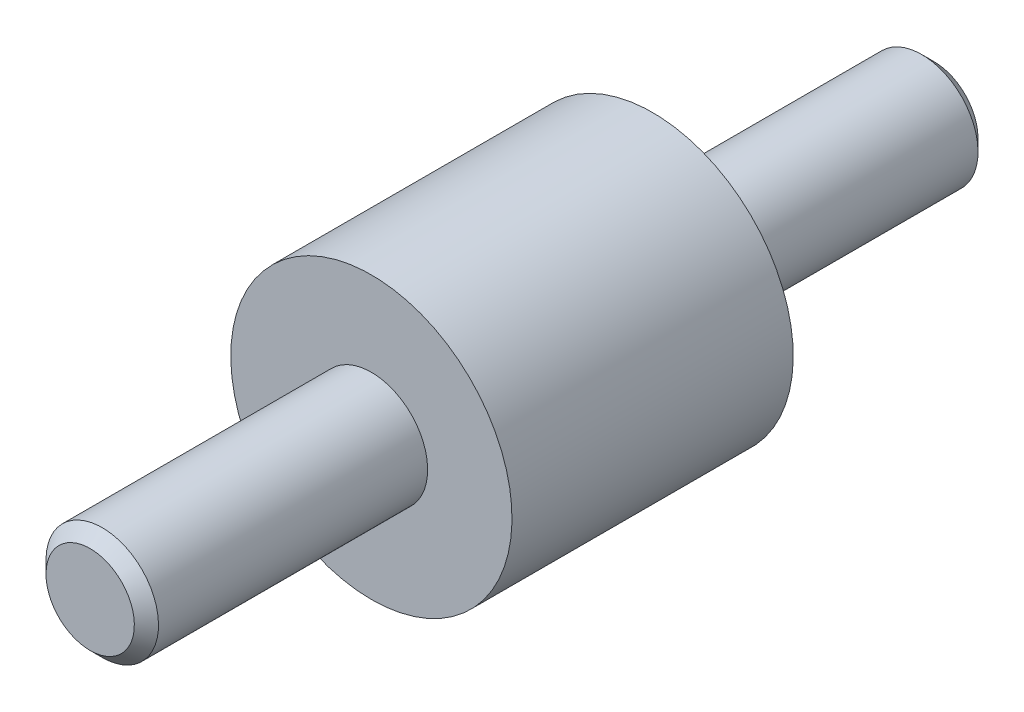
ISO-10303-21;
HEADER;
FILE_DESCRIPTION(('STEP AP214'),'2;1');
FILE_NAME('part.step','',(''),(''),'','','');
FILE_SCHEMA(('AUTOMOTIVE_DESIGN { 1 0 10303 214 1 1 1 1 }'));
ENDSEC;
DATA;
#1=APPLICATION_CONTEXT('core data for automotive mechanical design processes');
#2=APPLICATION_PROTOCOL_DEFINITION('international standard','automotive_design',2000,#1);
#3=PRODUCT_CONTEXT('',#1,'mechanical');
#4=PRODUCT('Part','Part','',(#3));
#5=PRODUCT_RELATED_PRODUCT_CATEGORY('part','',(#4));
#6=PRODUCT_DEFINITION_FORMATION('','',#4);
#7=PRODUCT_DEFINITION_CONTEXT('part definition',#1,'design');
#8=PRODUCT_DEFINITION('design','',#6,#7);
#9=PRODUCT_DEFINITION_SHAPE('','',#8);
#10=(LENGTH_UNIT() NAMED_UNIT(*) SI_UNIT(.MILLI.,.METRE.));
#11=(NAMED_UNIT(*) PLANE_ANGLE_UNIT() SI_UNIT($,.RADIAN.));
#12=(NAMED_UNIT(*) SI_UNIT($,.STERADIAN.) SOLID_ANGLE_UNIT());
#13=UNCERTAINTY_MEASURE_WITH_UNIT(LENGTH_MEASURE(1.E-05),#10,'distance_accuracy_value','');
#14=(GEOMETRIC_REPRESENTATION_CONTEXT(3) GLOBAL_UNCERTAINTY_ASSIGNED_CONTEXT((#13)) GLOBAL_UNIT_ASSIGNED_CONTEXT((#10,
#11,#12)) REPRESENTATION_CONTEXT('',''));
#15=CARTESIAN_POINT('',(0.,0.,0.));
#16=DIRECTION('',(0.,0.,1.));
#17=DIRECTION('',(1.,0.,0.));
#18=AXIS2_PLACEMENT_3D('',#15,#16,#17);
#19=CARTESIAN_POINT('',(4.6666666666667,0.,10.));
#20=DIRECTION('',(0.,0.,1.));
#21=DIRECTION('',(0.,-1.,0.));
#22=AXIS2_PLACEMENT_3D('',#19,#20,#21);
#23=PLANE('',#22);
#24=CARTESIAN_POINT('',(0.,0.,10.));
#25=DIRECTION('',(0.,0.,1.));
#26=DIRECTION('',(0.,-1.,0.));
#27=AXIS2_PLACEMENT_3D('',#24,#25,#26);
#28=CIRCLE('',#27,2.);
#29=CARTESIAN_POINT('',(0.,-2.,10.));
#30=VERTEX_POINT('',#29);
#31=EDGE_CURVE('E8',#30,#30,#28,.T.);
#32=ORIENTED_EDGE('',*,*,#31,.F.);
#33=EDGE_LOOP('',(#32));
#34=FACE_BOUND('',#33,.T.);
#35=CARTESIAN_POINT('',(0.,0.,10.));
#36=DIRECTION('',(0.,0.,1.));
#37=DIRECTION('',(0.,-1.,0.));
#38=AXIS2_PLACEMENT_3D('',#35,#36,#37);
#39=CIRCLE('',#38,5.);
#40=CARTESIAN_POINT('',(0.,-5.,10.));
#41=VERTEX_POINT('',#40);
#42=EDGE_CURVE('E22',#41,#41,#39,.T.);
#43=ORIENTED_EDGE('',*,*,#42,.T.);
#44=EDGE_LOOP('',(#43));
#45=FACE_BOUND('',#44,.T.);
#46=ADVANCED_FACE('F12',(#34,#45),#23,.T.);
#47=CARTESIAN_POINT('',(0.,0.,0.33333333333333));
#48=DIRECTION('',(0.,0.,1.));
#49=DIRECTION('',(0.,-1.,0.));
#50=AXIS2_PLACEMENT_3D('',#47,#48,#49);
#51=CYLINDRICAL_SURFACE('',#50,5.);
#52=CARTESIAN_POINT('',(0.,0.,0.));
#53=DIRECTION('',(0.,0.,1.));
#54=DIRECTION('',(0.,-1.,0.));
#55=AXIS2_PLACEMENT_3D('',#52,#53,#54);
#56=CIRCLE('',#55,5.);
#57=CARTESIAN_POINT('',(0.,-5.,0.));
#58=VERTEX_POINT('',#57);
#59=EDGE_CURVE('E26',#58,#58,#56,.T.);
#60=ORIENTED_EDGE('',*,*,#59,.T.);
#61=EDGE_LOOP('',(#60));
#62=FACE_BOUND('',#61,.T.);
#63=ORIENTED_EDGE('',*,*,#42,.F.);
#64=EDGE_LOOP('',(#63));
#65=FACE_BOUND('',#64,.T.);
#66=ADVANCED_FACE('F57',(#62,#65),#51,.T.);
#67=CARTESIAN_POINT('',(5.,0.,0.));
#68=DIRECTION('',(0.,0.,-1.));
#69=DIRECTION('',(0.,1.,0.));
#70=AXIS2_PLACEMENT_3D('',#67,#68,#69);
#71=PLANE('',#70);
#72=CARTESIAN_POINT('',(0.,0.,0.));
#73=DIRECTION('',(0.,0.,-1.));
#74=DIRECTION('',(0.,1.,0.));
#75=AXIS2_PLACEMENT_3D('',#72,#73,#74);
#76=CIRCLE('',#75,2.);
#77=CARTESIAN_POINT('',(0.,2.,0.));
#78=VERTEX_POINT('',#77);
#79=EDGE_CURVE('E18',#78,#78,#76,.T.);
#80=ORIENTED_EDGE('',*,*,#79,.F.);
#81=EDGE_LOOP('',(#80));
#82=FACE_BOUND('',#81,.T.);
#83=ORIENTED_EDGE('',*,*,#59,.F.);
#84=EDGE_LOOP('',(#83));
#85=FACE_BOUND('',#84,.T.);
#86=ADVANCED_FACE('F62',(#82,#85),#71,.T.);
#87=CARTESIAN_POINT('',(0.,0.,-10.));
#88=DIRECTION('',(0.,0.,1.));
#89=DIRECTION('',(0.,-1.,0.));
#90=AXIS2_PLACEMENT_3D('',#87,#88,#89);
#91=CYLINDRICAL_SURFACE('',#90,2.);
#92=CARTESIAN_POINT('',(0.,0.,-9.5705));
#93=DIRECTION('',(0.,0.,1.));
#94=DIRECTION('',(0.,-1.,0.));
#95=AXIS2_PLACEMENT_3D('',#92,#93,#94);
#96=CIRCLE('',#95,2.);
#97=CARTESIAN_POINT('',(0.,-2.,-9.5705));
#98=VERTEX_POINT('',#97);
#99=EDGE_CURVE('E31',#98,#98,#96,.T.);
#100=ORIENTED_EDGE('',*,*,#99,.T.);
#101=EDGE_LOOP('',(#100));
#102=FACE_BOUND('',#101,.T.);
#103=ORIENTED_EDGE('',*,*,#79,.T.);
#104=EDGE_LOOP('',(#103));
#105=FACE_BOUND('',#104,.T.);
#106=ADVANCED_FACE('F70',(#102,#105),#91,.T.);
#107=CARTESIAN_POINT('',(0.,0.,-9.5705));
#108=DIRECTION('',(0.,0.,1.));
#109=DIRECTION('',(0.,-1.,0.));
#110=AXIS2_PLACEMENT_3D('',#107,#108,#109);
#111=CONICAL_SURFACE('',#110,2.,0.785398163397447);
#112=CARTESIAN_POINT('',(0.,0.,-10.));
#113=DIRECTION('',(0.,0.,1.));
#114=DIRECTION('',(0.,-1.,0.));
#115=AXIS2_PLACEMENT_3D('',#112,#113,#114);
#116=CIRCLE('',#115,1.5705);
#117=CARTESIAN_POINT('',(0.,-1.5705,-10.));
#118=VERTEX_POINT('',#117);
#119=EDGE_CURVE('E34',#118,#118,#116,.T.);
#120=ORIENTED_EDGE('',*,*,#119,.T.);
#121=EDGE_LOOP('',(#120));
#122=FACE_BOUND('',#121,.T.);
#123=ORIENTED_EDGE('',*,*,#99,.F.);
#124=EDGE_LOOP('',(#123));
#125=FACE_BOUND('',#124,.T.);
#126=ADVANCED_FACE('F76',(#122,#125),#111,.T.);
#127=CARTESIAN_POINT('',(1.5705,0.,-10.));
#128=DIRECTION('',(0.,0.,-1.));
#129=DIRECTION('',(0.,1.,0.));
#130=AXIS2_PLACEMENT_3D('',#127,#128,#129);
#131=PLANE('',#130);
#132=ORIENTED_EDGE('',*,*,#119,.F.);
#133=EDGE_LOOP('',(#132));
#134=FACE_BOUND('',#133,.T.);
#135=ADVANCED_FACE('F80',(#134),#131,.T.);
#136=CARTESIAN_POINT('',(0.,0.,20.));
#137=DIRECTION('',(0.,0.,1.));
#138=DIRECTION('',(0.,-1.,0.));
#139=AXIS2_PLACEMENT_3D('',#136,#137,#138);
#140=PLANE('',#139);
#141=CARTESIAN_POINT('',(0.,0.,20.));
#142=DIRECTION('',(0.,0.,1.));
#143=DIRECTION('',(0.,-1.,0.));
#144=AXIS2_PLACEMENT_3D('',#141,#142,#143);
#145=CIRCLE('',#144,1.5705);
#146=CARTESIAN_POINT('',(0.,-1.5705,20.));
#147=VERTEX_POINT('',#146);
#148=EDGE_CURVE('E37',#147,#147,#145,.T.);
#149=ORIENTED_EDGE('',*,*,#148,.T.);
#150=EDGE_LOOP('',(#149));
#151=FACE_BOUND('',#150,.T.);
#152=ADVANCED_FACE('F54',(#151),#140,.T.);
#153=CARTESIAN_POINT('',(0.,0.,20.));
#154=DIRECTION('',(0.,0.,-1.));
#155=DIRECTION('',(0.,1.,0.));
#156=AXIS2_PLACEMENT_3D('',#153,#154,#155);
#157=CONICAL_SURFACE('',#156,1.5705,0.785398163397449);
#158=CARTESIAN_POINT('',(0.,0.,19.5705));
#159=DIRECTION('',(0.,0.,1.));
#160=DIRECTION('',(0.,-1.,0.));
#161=AXIS2_PLACEMENT_3D('',#158,#159,#160);
#162=CIRCLE('',#161,2.);
#163=CARTESIAN_POINT('',(0.,-2.,19.5705));
#164=VERTEX_POINT('',#163);
#165=EDGE_CURVE('E40',#164,#164,#162,.T.);
#166=ORIENTED_EDGE('',*,*,#165,.T.);
#167=EDGE_LOOP('',(#166));
#168=FACE_BOUND('',#167,.T.);
#169=ORIENTED_EDGE('',*,*,#148,.F.);
#170=EDGE_LOOP('',(#169));
#171=FACE_BOUND('',#170,.T.);
#172=ADVANCED_FACE('F44',(#168,#171),#157,.T.);
#173=CARTESIAN_POINT('',(0.,0.,10.));
#174=DIRECTION('',(0.,0.,1.));
#175=DIRECTION('',(0.,-1.,0.));
#176=AXIS2_PLACEMENT_3D('',#173,#174,#175);
#177=CYLINDRICAL_SURFACE('',#176,2.);
#178=ORIENTED_EDGE('',*,*,#31,.T.);
#179=EDGE_LOOP('',(#178));
#180=FACE_BOUND('',#179,.T.);
#181=ORIENTED_EDGE('',*,*,#165,.F.);
#182=EDGE_LOOP('',(#181));
#183=FACE_BOUND('',#182,.T.);
#184=ADVANCED_FACE('F47',(#180,#183),#177,.T.);
#185=CLOSED_SHELL('',(#46,#66,#86,#106,#126,#135,#152,#172,#184));
#186=MANIFOLD_SOLID_BREP('B1',#185);
#187=ADVANCED_BREP_SHAPE_REPRESENTATION('',(#18,#186),#14);
#188=SHAPE_DEFINITION_REPRESENTATION(#9,#187);
ENDSEC;
END-ISO-10303-21;
